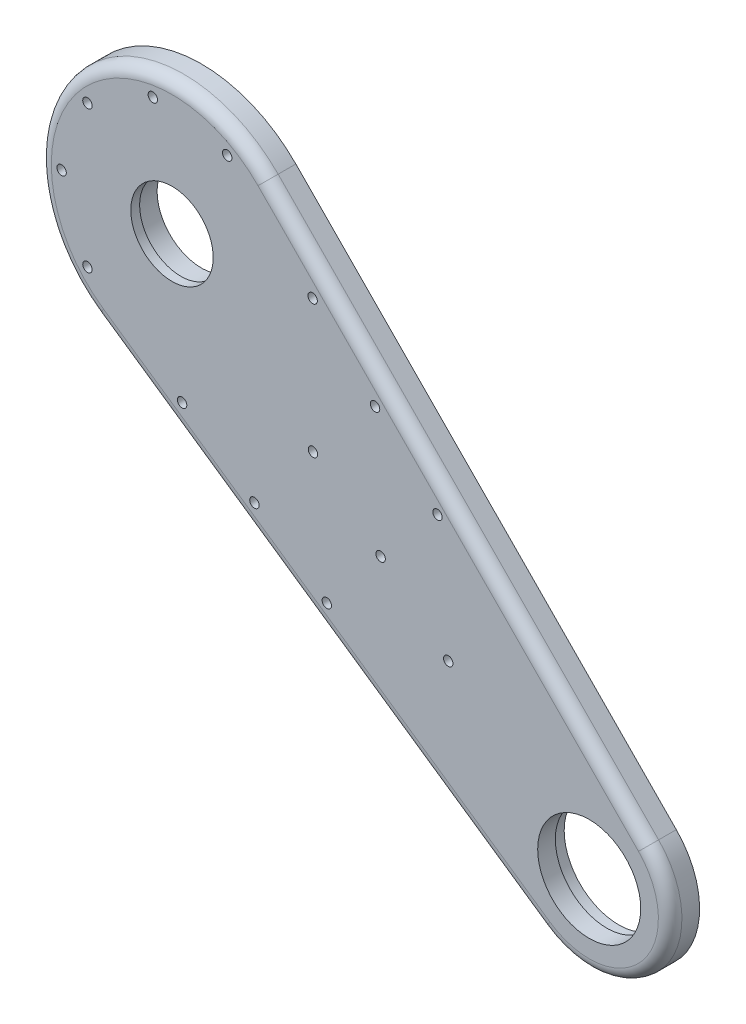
from build123d import *

# Parameters (mm, degrees)
SKETCH1_R           = 17.5
SKETCH1_R_2         = 1.6
BOSS_EXTRUDE1_DEPTH = 10
SKETCH2_R           = 18.5
CUT_EXTRUDE1_DEPTH  = 4
SKETCH3_R           = 1.6
CUT_EXTRUDE2_DEPTH  = 224.991888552
SKETCH4_R           = 14
CUT_EXTRUDE3_DEPTH  = 224.991888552
SKETCH4_3_R         = 15.0625
SKETCH4_3_R_2       = 14
CUT_EXTRUDE4_DEPTH  = 7
FILLET1_R           = 4


with BuildPart() as part:
    # Sketch1 → Boss-Extrude1 (new body)
    with BuildSketch(Plane.XY.offset(37)):
        with BuildLine():
            Line((-25.534872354, -37.053613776), (126.113577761, -141.559582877))
            ThreePointArc((126.113577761, -141.559582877), (162.784444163, -136.592367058), (161.308367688, -99.616065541))
            Line((161.308367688, -99.616065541), (32.056602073, 31.581232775))
            ThreePointArc((32.056602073, 31.581232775), (-34.47199994, 28.925442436), (-25.534872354, -37.053613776))
        make_face()
        with Locations((141.718221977, -118.915707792)):
            Circle(SKETCH1_R, mode=Mode.SUBTRACT)
        with Locations((70.859110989, -59.457853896)):
            Circle(SKETCH1_R_2, mode=Mode.SUBTRACT)
        with Locations((93.840444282, -78.741482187)):
            Circle(SKETCH1_R_2, mode=Mode.SUBTRACT)
        with Locations((47.877777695, -40.174225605)):
            Circle(SKETCH1_R_2, mode=Mode.SUBTRACT)
        with Locations((47.767990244, 4.946625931)):
            Circle(SKETCH1_R_2, mode=Mode.SUBTRACT)
        with Locations((3.423348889, -47.901259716)):
            Circle(SKETCH1_R_2, mode=Mode.SUBTRACT)
        with Locations((68.973861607, -16.273907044)):
            Circle(SKETCH1_R_2, mode=Mode.SUBTRACT)
        with Locations((90.17973297, -37.494440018)):
            Circle(SKETCH1_R_2, mode=Mode.SUBTRACT)
        with Locations((28.003855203, -65.100059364)):
            Circle(SKETCH1_R_2, mode=Mode.SUBTRACT)
        with Locations((52.584361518, -82.298859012)):
            Circle(SKETCH1_R_2, mode=Mode.SUBTRACT)
    extrude(amount=BOSS_EXTRUDE1_DEPTH)

    # Sketch2 → Cut-Extrude1 (cut)
    with BuildSketch(Plane(origin=(0, 0, 37), x_dir=(-1, 0, 0), z_dir=(0, 0, -1))):
        with Locations((-141.718221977, -118.915707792)):
            Circle(SKETCH2_R)
    extrude(amount=-CUT_EXTRUDE1_DEPTH, mode=Mode.SUBTRACT)

    # Sketch3 → Cut-Extrude2 (cut, through all)
    with BuildSketch(Plane(origin=(0, 0, 37), x_dir=(-1, 0, 0), z_dir=(0, 0, -1))):
        with Locations((-18.75, 32.475952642)):
            Circle(SKETCH3_R)
        with Locations((6.511806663, 36.930290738)):
            Circle(SKETCH3_R)
        with Locations((28.726666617, 24.104535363)):
            Circle(SKETCH3_R)
        with Locations((37.5, 0)):
            Circle(SKETCH3_R)
        with Locations((28.726666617, -24.104535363)):
            Circle(SKETCH3_R)
    extrude(amount=-CUT_EXTRUDE2_DEPTH, mode=Mode.SUBTRACT)

    # Sketch4 → Cut-Extrude3 (cut, through all)
    with BuildSketch(Plane(origin=(0, 0, 37), x_dir=(-1, 0, 0), z_dir=(0, 0, -1))):
        Circle(SKETCH4_R)
    extrude(amount=-CUT_EXTRUDE3_DEPTH, mode=Mode.SUBTRACT)

    # Sketch4_3 → Cut-Extrude4 (cut)
    with BuildSketch(Plane(origin=(0, 0, 37), x_dir=(-1, 0, 0), z_dir=(0, 0, -1))):
        Circle(SKETCH4_3_R)
        Circle(SKETCH4_3_R_2, mode=Mode.SUBTRACT)
    extrude(amount=-CUT_EXTRUDE4_DEPTH, mode=Mode.SUBTRACT)

    # Fillet1
    fillet1_edges = [part.edges().sort_by_distance(p)[0] for p in [
        (162.784444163, -136.592367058, 47),
        (96.68248488, -34.017416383, 47),
        (-34.47199994, 28.925442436, 47),
        (50.289352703, -89.306598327, 47),
    ]]
    fillet(fillet1_edges, radius=FILLET1_R)


solid = part.part
